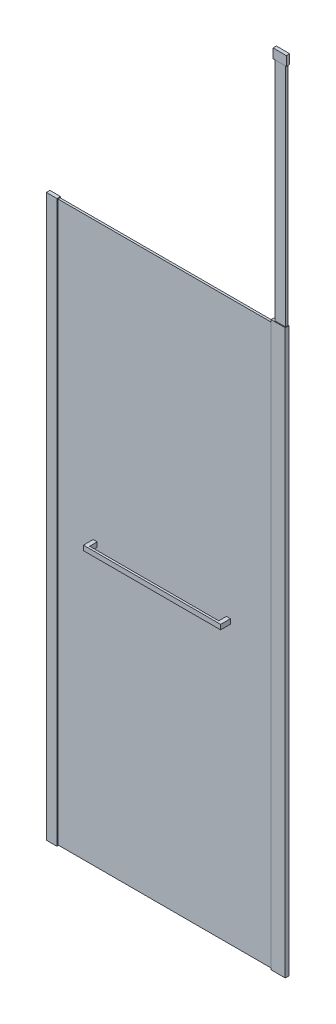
from build123d import *

# Parameters (mm, degrees)
DODANIE_WYCI_GNI_CIE1_START         = 3
DODANIE_WYCI_GNI_CIE1_DEPTH         = 2100
SZKIC2_W                            = 847
SZKIC2_H                            = 8
DODANIE_WYCI_GNI_CIE2_DEPTH         = 2100
DODANIE_WYCI_GNI_CIE3_DEPTH         = 2108
SZKIC4_W                            = 40
SZKIC4_H                            = 13.3
DODANIE_WYCI_GNI_CIE4_DEPTH         = 3
SZKIC5_W                            = 53
SZKIC5_H                            = 14
DODANIE_WYCI_GNI_CIE5_DEPTH         = 3
SZKIC6_W                            = 8.1
SZKIC6_H                            = 7.8
DODANIE_WYCI_GNI_CIE6_DEPTH         = 15
SZKIC7_W                            = 53
SZKIC7_H                            = 14
DODANIE_WYCI_GNI_CIE7_DEPTH         = 3
SZKIC8_W                            = 40
SZKIC8_H                            = 13.3
DODANIE_WYCI_GNI_CIE8_DEPTH         = 3
SZKIC9_W                            = 40
SZKIC9_H                            = 8
DODANIE_WYCI_GNI_CIE9_DEPTH         = 883
DODANIE_WYCI_GNI_CIE10_START        = -32
SZKIC10_W                           = 50
SZKIC10_H                           = 12.5
DODANIE_WYCI_GNI_CIE10_DEPTH        = 35
DODANIE_WYCI_GNI_CIE11_DEPTH        = 36.5
DODANIE_WYCI_GNI_CIE11_DEPTH_BACK   = 18
SZKIC12_W                           = 15
SZKIC12_H                           = 18
DODANIE_WYCI_GNI_CIE11_2_DEPTH      = 36.5
DODANIE_WYCI_GNI_CIE11_2_DEPTH_BACK = 18
SZKIC13_W                           = 8
SZKIC13_H                           = 18
DODANIE_WYCI_GNI_CIE12_DEPTH        = 485


with BuildPart() as part:
    # Szkic1 → Dodanie-wyci_gni_cie1 (new body)
    with BuildSketch(Plane(origin=(0, 0, 0), x_dir=(1, 0, 0), z_dir=(0, 1, 0)).offset(DODANIE_WYCI_GNI_CIE1_START)):
        Polygon((0, 0), (0, 13.3), (40, 13.3), (40, 11.4), (6.5, 11.4), (6.5, 3.4), (40, 3.4), (40, 0), align=None)
    extrude(amount=DODANIE_WYCI_GNI_CIE1_DEPTH)

    # Szkic4 → Dodanie-wyci_gni_cie4 (add)
    with BuildSketch(Plane(origin=(0, 2103, 0), x_dir=(1, 0, 0), z_dir=(0, 1, 0))):
        with Locations((20, 6.65)):
            Rectangle(SZKIC4_W, SZKIC4_H)
    extrude(amount=DODANIE_WYCI_GNI_CIE4_DEPTH)

    # Szkic8 → Dodanie-wyci_gni_cie8 (add)
    with BuildSketch(Plane.XZ.offset(-3)):
        with Locations((20, -6.65)):
            Rectangle(SZKIC8_W, SZKIC8_H)
    extrude(amount=DODANIE_WYCI_GNI_CIE8_DEPTH)


with BuildPart() as body_2:
    # Szkic2 → Dodanie-wyci_gni_cie2 (new body)
    with BuildSketch(Plane.XZ.offset(-3)):
        with Locations((430, -7.4)):
            Rectangle(SZKIC2_W, SZKIC2_H)
    extrude(amount=-DODANIE_WYCI_GNI_CIE2_DEPTH)


with BuildPart() as body_3:
    # Szkic3 → Dodanie-wyci_gni_cie3 (new body)
    with BuildSketch(Plane.XZ.offset(-3)):
        Polygon((843.4, -3.4), (843.4, -0.4), (896.4, -0.4), (896.4, -14.4), (843.4, -14.4), (843.4, -11.4), (853.5, -11.4), (853.5, -3.4), align=None)
    extrude(amount=-DODANIE_WYCI_GNI_CIE3_DEPTH)

    # Szkic5 → Dodanie-wyci_gni_cie5 (add)
    with BuildSketch(Plane(origin=(0, 2111, 0), x_dir=(1, 0, 0), z_dir=(0, 1, 0))):
        with Locations((869.9, 7.4)):
            Rectangle(SZKIC5_W, SZKIC5_H)
    extrude(amount=DODANIE_WYCI_GNI_CIE5_DEPTH)

    # Szkic6 → Dodanie-wyci_gni_cie6 (add)
    with BuildSketch(Plane.ZY.offset(-843.4)):
        with Locations((-7.4, 2107.1)):
            Rectangle(SZKIC6_W, SZKIC6_H)
    extrude(amount=-DODANIE_WYCI_GNI_CIE6_DEPTH)

    # Szkic7 → Dodanie-wyci_gni_cie7 (add)
    with BuildSketch(Plane.XZ.offset(-3)):
        with Locations((869.9, -7.4)):
            Rectangle(SZKIC7_W, SZKIC7_H)
    extrude(amount=DODANIE_WYCI_GNI_CIE7_DEPTH)


with BuildPart() as body_4:
    # Szkic9 → Dodanie-wyci_gni_cie9 (new body)
    with BuildSketch(Plane(origin=(0, 2114, 2099.6), x_dir=(-1, 0, 0), z_dir=(0, -1, 0))):
        with Locations((-874.9, 2107)):
            Rectangle(SZKIC9_W, SZKIC9_H)
    extrude(amount=-DODANIE_WYCI_GNI_CIE9_DEPTH)

    # Szkic10 → Dodanie-wyci_gni_cie10 (add)
    with BuildSketch(Plane(origin=(0, 2997, 0), x_dir=(-1, 0, 0), z_dir=(0, 1, 0)).offset(DODANIE_WYCI_GNI_CIE10_START)):
        with Locations((-874.9, -7.4)):
            Rectangle(SZKIC10_W, SZKIC10_H)
    extrude(amount=DODANIE_WYCI_GNI_CIE10_DEPTH)


with BuildPart() as body_5:
    # Szkic12 → Dodanie-wyci_gni_cie11 (new, two sides: drawn at the far end of the back side and taken through both)
    with BuildSketch(Plane.XY.offset(-3.4).offset(-DODANIE_WYCI_GNI_CIE11_DEPTH_BACK)):
        with Locations((180, 1053)):
            Rectangle(SZKIC12_W, SZKIC12_H)
    extrude(amount=DODANIE_WYCI_GNI_CIE11_DEPTH + DODANIE_WYCI_GNI_CIE11_DEPTH_BACK)



with BuildPart() as body_6:
    # Szkic12 → Dodanie-wyci_gni_cie11 2 (new, two sides: drawn at the far end of the back side and taken through both)
    with BuildSketch(Plane.XY.offset(-3.4).offset(-DODANIE_WYCI_GNI_CIE11_2_DEPTH_BACK)):
        with Locations((680, 1053)):
            Rectangle(SZKIC12_W, SZKIC12_H)
    extrude(amount=DODANIE_WYCI_GNI_CIE11_2_DEPTH + DODANIE_WYCI_GNI_CIE11_2_DEPTH_BACK)


with BuildPart() as body_5_1:
    add(body_5.part)

    add(body_6.part)  # Dodanie-wyci_gni_cie12 merges body 6
    # Szkic13 → Dodanie-wyci_gni_cie12 (add)
    with BuildSketch(Plane(origin=(187.5, 0, 0), x_dir=(0, 0, -1), z_dir=(1, 0, 0))):
        with Locations((-29.1, 1053)):
            Rectangle(SZKIC13_W, SZKIC13_H)
    extrude(amount=DODANIE_WYCI_GNI_CIE12_DEPTH)


solid = Compound([part.part, body_2.part, body_3.part, body_4.part, body_5_1.part])
